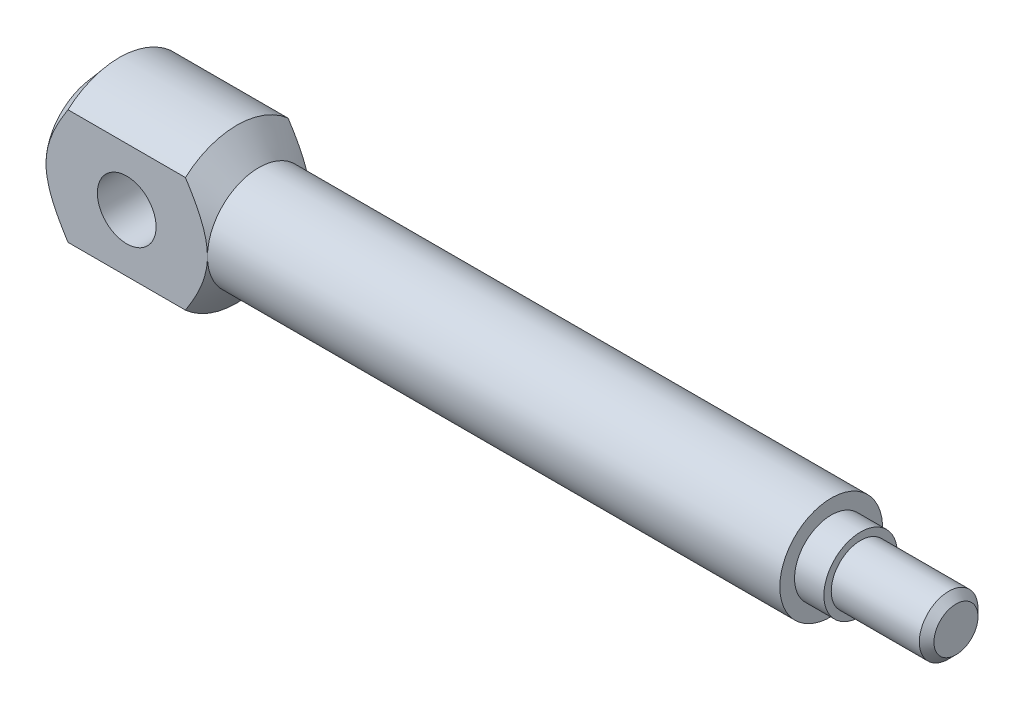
ISO-10303-21;
HEADER;
FILE_DESCRIPTION(('STEP AP214'),'2;1');
FILE_NAME('part.step','',(''),(''),'','','');
FILE_SCHEMA(('AUTOMOTIVE_DESIGN { 1 0 10303 214 1 1 1 1 }'));
ENDSEC;
DATA;
#1=APPLICATION_CONTEXT('core data for automotive mechanical design processes');
#2=APPLICATION_PROTOCOL_DEFINITION('international standard','automotive_design',2000,#1);
#3=PRODUCT_CONTEXT('',#1,'mechanical');
#4=PRODUCT('Part','Part','',(#3));
#5=PRODUCT_RELATED_PRODUCT_CATEGORY('part','',(#4));
#6=PRODUCT_DEFINITION_FORMATION('','',#4);
#7=PRODUCT_DEFINITION_CONTEXT('part definition',#1,'design');
#8=PRODUCT_DEFINITION('design','',#6,#7);
#9=PRODUCT_DEFINITION_SHAPE('','',#8);
#10=(LENGTH_UNIT() NAMED_UNIT(*) SI_UNIT(.MILLI.,.METRE.));
#11=(NAMED_UNIT(*) PLANE_ANGLE_UNIT() SI_UNIT($,.RADIAN.));
#12=(NAMED_UNIT(*) SI_UNIT($,.STERADIAN.) SOLID_ANGLE_UNIT());
#13=UNCERTAINTY_MEASURE_WITH_UNIT(LENGTH_MEASURE(1.E-05),#10,'distance_accuracy_value','');
#14=(GEOMETRIC_REPRESENTATION_CONTEXT(3) GLOBAL_UNCERTAINTY_ASSIGNED_CONTEXT((#13)) GLOBAL_UNIT_ASSIGNED_CONTEXT((#10,
#11,#12)) REPRESENTATION_CONTEXT('',''));
#15=CARTESIAN_POINT('',(0.,0.,0.));
#16=DIRECTION('',(0.,0.,1.));
#17=DIRECTION('',(1.,0.,0.));
#18=AXIS2_PLACEMENT_3D('',#15,#16,#17);
#19=CARTESIAN_POINT('',(22.,0.,0.));
#20=DIRECTION('',(-1.,0.,0.));
#21=DIRECTION('',(0.,0.,1.));
#22=AXIS2_PLACEMENT_3D('',#19,#20,#21);
#23=CONICAL_SURFACE('',#22,6.99999999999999,0.862170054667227);
#24=CARTESIAN_POINT('',(13.8028857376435,-15.0114258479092,-7.));
#25=CARTESIAN_POINT('',(14.0641424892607,-14.6750754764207,-7.));
#26=CARTESIAN_POINT('',(14.3244616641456,-14.3379913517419,-7.));
#27=CARTESIAN_POINT('',(14.842741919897,-13.6619834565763,-7.));
#28=CARTESIAN_POINT('',(15.1007028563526,-13.3230595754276,-7.));
#29=CARTESIAN_POINT('',(15.6144057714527,-12.6421740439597,-7.));
#30=CARTESIAN_POINT('',(15.8701404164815,-12.3002068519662,-7.));
#31=CARTESIAN_POINT('',(16.3780119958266,-11.6136216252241,-7.));
#32=CARTESIAN_POINT('',(16.6301490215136,-11.2690036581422,-7.));
#33=CARTESIAN_POINT('',(17.1533738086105,-10.5439847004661,-7.));
#34=CARTESIAN_POINT('',(17.4240177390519,-10.1632624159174,-7.));
#35=CARTESIAN_POINT('',(17.9582294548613,-9.39682648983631,-7.));
#36=CARTESIAN_POINT('',(18.2217966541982,-9.01111243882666,-7.));
#37=CARTESIAN_POINT('',(18.739135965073,-8.23370823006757,-7.));
#38=CARTESIAN_POINT('',(18.9929181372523,-7.84202482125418,-7.));
#39=CARTESIAN_POINT('',(19.3636672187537,-7.24833774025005,-7.));
#40=CARTESIAN_POINT('',(19.4855889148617,-7.04942766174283,-7.));
#41=CARTESIAN_POINT('',(19.7254862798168,-6.64924604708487,-7.));
#42=CARTESIAN_POINT('',(19.8434621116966,-6.44797460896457,-7.));
#43=CARTESIAN_POINT('',(20.0724388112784,-6.04670674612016,-7.));
#44=CARTESIAN_POINT('',(20.1835310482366,-5.8467625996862,-7.));
#45=CARTESIAN_POINT('',(20.4002753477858,-5.44395659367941,-7.));
#46=CARTESIAN_POINT('',(20.5059278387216,-5.24109496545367,-7.));
#47=CARTESIAN_POINT('',(20.7107664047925,-4.83191673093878,-7.));
#48=CARTESIAN_POINT('',(20.8099472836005,-4.62559751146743,-7.));
#49=CARTESIAN_POINT('',(21.0003740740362,-4.20931118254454,-7.));
#50=CARTESIAN_POINT('',(21.0916201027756,-3.99934412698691,-7.));
#51=CARTESIAN_POINT('',(21.2623900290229,-3.58067292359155,-7.));
#52=CARTESIAN_POINT('',(21.3421467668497,-3.37206438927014,-7.));
#53=CARTESIAN_POINT('',(21.4907216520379,-2.95094111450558,-7.));
#54=CARTESIAN_POINT('',(21.5595391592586,-2.7384261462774,-7.));
#55=CARTESIAN_POINT('',(21.6841158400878,-2.30993046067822,-7.));
#56=CARTESIAN_POINT('',(21.7398958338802,-2.09395586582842,-7.));
#57=CARTESIAN_POINT('',(21.8364805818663,-1.65872734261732,-7.));
#58=CARTESIAN_POINT('',(21.8772901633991,-1.43947449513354,-7.));
#59=CARTESIAN_POINT('',(21.9488644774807,-0.952609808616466,-7.));
#60=CARTESIAN_POINT('',(21.9757817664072,-0.684413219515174,-7.));
#61=CARTESIAN_POINT('',(22.0030921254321,-0.146686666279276,-7.));
#62=CARTESIAN_POINT('',(22.0034883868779,0.122843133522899,-7.));
#63=CARTESIAN_POINT('',(21.9776994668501,0.661384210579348,-7.));
#64=CARTESIAN_POINT('',(21.9514378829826,0.930391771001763,-7.));
#65=CARTESIAN_POINT('',(21.874205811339,1.46481538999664,-7.));
#66=CARTESIAN_POINT('',(21.8232279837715,1.73023035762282,-7.));
#67=CARTESIAN_POINT('',(21.6734352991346,2.36841443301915,-7.));
#68=CARTESIAN_POINT('',(21.5634865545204,2.73856910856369,-7.));
#69=CARTESIAN_POINT('',(21.3737299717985,3.28492693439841,-7.));
#70=CARTESIAN_POINT('',(21.3062985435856,3.46565617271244,-7.));
#71=CARTESIAN_POINT('',(21.1643191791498,3.8243008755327,-7.));
#72=CARTESIAN_POINT('',(21.0897718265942,4.00221656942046,-7.));
#73=CARTESIAN_POINT('',(20.9334237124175,4.3580769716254,-7.));
#74=CARTESIAN_POINT('',(20.8515290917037,4.53598011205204,-7.));
#75=CARTESIAN_POINT('',(20.6824292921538,4.88923966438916,-7.));
#76=CARTESIAN_POINT('',(20.5952240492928,5.06459604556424,-7.));
#77=CARTESIAN_POINT('',(20.4163360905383,5.41291047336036,-7.));
#78=CARTESIAN_POINT('',(20.3246552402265,5.58586948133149,-7.));
#79=CARTESIAN_POINT('',(20.137450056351,5.92967848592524,-7.));
#80=CARTESIAN_POINT('',(20.0419259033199,6.10052858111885,-7.));
#81=CARTESIAN_POINT('',(19.8261988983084,6.47773827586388,-7.));
#82=CARTESIAN_POINT('',(19.7051916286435,6.68363733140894,-7.));
#83=CARTESIAN_POINT('',(19.4590899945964,7.09298260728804,-7.));
#84=CARTESIAN_POINT('',(19.333995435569,7.29642871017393,-7.));
#85=CARTESIAN_POINT('',(18.9535540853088,7.90363714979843,-7.));
#86=CARTESIAN_POINT('',(18.6930925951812,8.30419560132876,-7.));
#87=CARTESIAN_POINT('',(18.1622071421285,9.09907504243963,-7.));
#88=CARTESIAN_POINT('',(17.8917752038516,9.49339066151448,-7.));
#89=CARTESIAN_POINT('',(17.3436931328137,10.2769034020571,-7.));
#90=CARTESIAN_POINT('',(17.0660437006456,10.6661010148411,-7.));
#91=CARTESIAN_POINT('',(16.5043485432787,11.4417645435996,-7.));
#92=CARTESIAN_POINT('',(16.2202850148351,11.8282175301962,-7.));
#93=CARTESIAN_POINT('',(15.6478727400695,12.5979437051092,-7.));
#94=CARTESIAN_POINT('',(15.3595239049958,12.9812168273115,-7.));
#95=CARTESIAN_POINT('',(14.7795857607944,13.7450170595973,-7.));
#96=CARTESIAN_POINT('',(14.4879980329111,14.1255453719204,-7.));
#97=CARTESIAN_POINT('',(13.9021106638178,14.8845097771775,-7.));
#98=CARTESIAN_POINT('',(13.6078110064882,15.2629458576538,-7.));
#99=CARTESIAN_POINT('',(12.7985992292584,16.2972807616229,-7.));
#100=CARTESIAN_POINT('',(12.2814637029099,16.9514396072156,-7.));
#101=CARTESIAN_POINT('',(11.2423596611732,18.2560408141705,-7.));
#102=CARTESIAN_POINT('',(10.7203905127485,18.9064826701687,-7.));
#103=CARTESIAN_POINT('',(9.67610130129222,20.2005215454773,-7.));
#104=CARTESIAN_POINT('',(9.15380294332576,20.8441360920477,-7.));
#105=CARTESIAN_POINT('',(8.36837836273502,21.8078617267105,-7.));
#106=CARTESIAN_POINT('',(8.10626103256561,22.128796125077,-7.));
#107=CARTESIAN_POINT('',(7.5814289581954,22.7701752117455,-7.));
#108=CARTESIAN_POINT('',(7.3187142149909,23.0906199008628,-7.));
#109=CARTESIAN_POINT('',(7.05573777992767,23.4108497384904,-7.));
#110=B_SPLINE_CURVE_WITH_KNOTS('',3,(#24,#25,#26,#27,#28,#29,#30,#31,#32,#33,#34,#35,#36,#37,
#38,#39,#40,#41,#42,#43,#44,#45,#46,#47,#48,#49,#50,#51,#52,#53,#54,#55,#56,#57,#58,#59,#60,#61,
#62,#63,#64,#65,#66,#67,#68,#69,#70,#71,#72,#73,#74,#75,#76,#77,#78,#79,#80,#81,#82,#83,#84,#85,
#86,#87,#88,#89,#90,#91,#92,#93,#94,#95,#96,#97,#98,#99,#100,#101,#102,#103,#104,#105,#106,#107,
#108,#109),.UNSPECIFIED.,.F.,.F.,(4,2,2,2,2,2,2,2,2,2,2,2,2,2,2,2,2,2,2,2,2,2,2,2,2,2,2,2,2,2,2,
2,2,2,2,2,2,2,2,2,2,2,4),(0.,1.27769017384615,2.55545807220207,3.83648351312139,
5.11747636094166,6.5187616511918,7.9201626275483,9.32008206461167,10.0199544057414,
10.7197977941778,11.4059297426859,12.0920075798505,12.7786296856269,13.465241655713,
14.1349919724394,14.8047814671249,15.4734939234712,16.1419905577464,16.9493495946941,
17.7566114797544,18.5661935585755,19.3760162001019,20.5320521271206,21.1106545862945,
21.6892096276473,22.2766553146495,22.864108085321,23.4513180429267,24.038500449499,
24.7549146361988,25.4713629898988,26.9045163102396,28.3388419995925,29.7730289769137,
31.2118608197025,32.6507225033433,34.0889101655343,35.5271063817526,38.028706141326,
40.5306382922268,43.017255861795,44.2603721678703,45.5034864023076),.UNSPECIFIED.);
#111=CARTESIAN_POINT('',(19.,7.82623792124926,-7.));
#112=VERTEX_POINT('',#111);
#113=CARTESIAN_POINT('',(22.,0.,-7.));
#114=VERTEX_POINT('',#113);
#115=EDGE_CURVE('E169',#112,#114,#110,.F.);
#116=ORIENTED_EDGE('',*,*,#115,.F.);
#117=CARTESIAN_POINT('',(19.,0.,0.));
#118=DIRECTION('',(-1.,0.,0.));
#119=DIRECTION('',(0.,0.,1.));
#120=AXIS2_PLACEMENT_3D('',#117,#118,#119);
#121=CIRCLE('',#120,10.5);
#122=CARTESIAN_POINT('',(19.,7.82623792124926,7.));
#123=VERTEX_POINT('',#122);
#124=EDGE_CURVE('E95',#123,#112,#121,.T.);
#125=ORIENTED_EDGE('',*,*,#124,.F.);
#126=CARTESIAN_POINT('',(13.8028857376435,-15.0114258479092,7.));
#127=CARTESIAN_POINT('',(14.0641424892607,-14.6750754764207,7.));
#128=CARTESIAN_POINT('',(14.3244616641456,-14.3379913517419,7.));
#129=CARTESIAN_POINT('',(14.842741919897,-13.6619834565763,7.));
#130=CARTESIAN_POINT('',(15.1007028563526,-13.3230595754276,7.));
#131=CARTESIAN_POINT('',(15.6144057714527,-12.6421740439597,7.));
#132=CARTESIAN_POINT('',(15.8701404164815,-12.3002068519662,7.));
#133=CARTESIAN_POINT('',(16.3780119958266,-11.6136216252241,7.));
#134=CARTESIAN_POINT('',(16.6301490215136,-11.2690036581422,7.));
#135=CARTESIAN_POINT('',(17.1533738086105,-10.5439847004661,7.));
#136=CARTESIAN_POINT('',(17.4240177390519,-10.1632624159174,7.));
#137=CARTESIAN_POINT('',(17.9582294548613,-9.39682648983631,7.));
#138=CARTESIAN_POINT('',(18.2217966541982,-9.01111243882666,7.));
#139=CARTESIAN_POINT('',(18.739135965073,-8.23370823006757,7.));
#140=CARTESIAN_POINT('',(18.9929181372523,-7.84202482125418,7.));
#141=CARTESIAN_POINT('',(19.3636672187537,-7.24833774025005,7.));
#142=CARTESIAN_POINT('',(19.4855889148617,-7.04942766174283,7.));
#143=CARTESIAN_POINT('',(19.7254862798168,-6.64924604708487,7.));
#144=CARTESIAN_POINT('',(19.8434621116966,-6.44797460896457,7.));
#145=CARTESIAN_POINT('',(20.0724388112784,-6.04670674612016,7.));
#146=CARTESIAN_POINT('',(20.1835310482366,-5.8467625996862,7.));
#147=CARTESIAN_POINT('',(20.4002753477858,-5.44395659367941,7.));
#148=CARTESIAN_POINT('',(20.5059278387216,-5.24109496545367,7.));
#149=CARTESIAN_POINT('',(20.7107664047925,-4.83191673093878,7.));
#150=CARTESIAN_POINT('',(20.8099472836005,-4.62559751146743,7.));
#151=CARTESIAN_POINT('',(21.0003740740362,-4.20931118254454,7.));
#152=CARTESIAN_POINT('',(21.0916201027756,-3.99934412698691,7.));
#153=CARTESIAN_POINT('',(21.2623900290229,-3.58067292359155,7.));
#154=CARTESIAN_POINT('',(21.3421467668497,-3.37206438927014,7.));
#155=CARTESIAN_POINT('',(21.4907216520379,-2.95094111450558,7.));
#156=CARTESIAN_POINT('',(21.5595391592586,-2.7384261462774,7.));
#157=CARTESIAN_POINT('',(21.6841158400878,-2.30993046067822,7.));
#158=CARTESIAN_POINT('',(21.7398958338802,-2.09395586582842,7.));
#159=CARTESIAN_POINT('',(21.8364805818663,-1.65872734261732,7.));
#160=CARTESIAN_POINT('',(21.8772901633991,-1.43947449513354,7.));
#161=CARTESIAN_POINT('',(21.9488644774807,-0.952609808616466,7.));
#162=CARTESIAN_POINT('',(21.9757817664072,-0.684413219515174,7.));
#163=CARTESIAN_POINT('',(22.0030921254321,-0.146686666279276,7.));
#164=CARTESIAN_POINT('',(22.0034883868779,0.122843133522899,7.));
#165=CARTESIAN_POINT('',(21.9776994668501,0.661384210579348,7.));
#166=CARTESIAN_POINT('',(21.9514378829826,0.930391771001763,7.));
#167=CARTESIAN_POINT('',(21.874205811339,1.46481538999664,7.));
#168=CARTESIAN_POINT('',(21.8232279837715,1.73023035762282,7.));
#169=CARTESIAN_POINT('',(21.6734352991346,2.36841443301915,7.));
#170=CARTESIAN_POINT('',(21.5634865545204,2.73856910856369,7.));
#171=CARTESIAN_POINT('',(21.3737299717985,3.28492693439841,7.));
#172=CARTESIAN_POINT('',(21.3062985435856,3.46565617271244,7.));
#173=CARTESIAN_POINT('',(21.1643191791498,3.8243008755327,7.));
#174=CARTESIAN_POINT('',(21.0897718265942,4.00221656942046,7.));
#175=CARTESIAN_POINT('',(20.9334237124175,4.3580769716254,7.));
#176=CARTESIAN_POINT('',(20.8515290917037,4.53598011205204,7.));
#177=CARTESIAN_POINT('',(20.6824292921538,4.88923966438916,7.));
#178=CARTESIAN_POINT('',(20.5952240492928,5.06459604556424,7.));
#179=CARTESIAN_POINT('',(20.4163360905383,5.41291047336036,7.));
#180=CARTESIAN_POINT('',(20.3246552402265,5.58586948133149,7.));
#181=CARTESIAN_POINT('',(20.137450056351,5.92967848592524,7.));
#182=CARTESIAN_POINT('',(20.0419259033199,6.10052858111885,7.));
#183=CARTESIAN_POINT('',(19.8261988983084,6.47773827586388,7.));
#184=CARTESIAN_POINT('',(19.7051916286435,6.68363733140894,7.));
#185=CARTESIAN_POINT('',(19.4590899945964,7.09298260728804,7.));
#186=CARTESIAN_POINT('',(19.333995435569,7.29642871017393,7.));
#187=CARTESIAN_POINT('',(18.9535540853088,7.90363714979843,7.));
#188=CARTESIAN_POINT('',(18.6930925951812,8.30419560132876,7.));
#189=CARTESIAN_POINT('',(18.1622071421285,9.09907504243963,7.));
#190=CARTESIAN_POINT('',(17.8917752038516,9.49339066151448,7.));
#191=CARTESIAN_POINT('',(17.3436931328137,10.2769034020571,7.));
#192=CARTESIAN_POINT('',(17.0660437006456,10.6661010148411,7.));
#193=CARTESIAN_POINT('',(16.5043485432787,11.4417645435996,7.));
#194=CARTESIAN_POINT('',(16.2202850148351,11.8282175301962,7.));
#195=CARTESIAN_POINT('',(15.6478727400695,12.5979437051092,7.));
#196=CARTESIAN_POINT('',(15.3595239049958,12.9812168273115,7.));
#197=CARTESIAN_POINT('',(14.7795857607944,13.7450170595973,7.));
#198=CARTESIAN_POINT('',(14.4879980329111,14.1255453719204,7.));
#199=CARTESIAN_POINT('',(13.9021106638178,14.8845097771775,7.));
#200=CARTESIAN_POINT('',(13.6078110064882,15.2629458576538,7.));
#201=CARTESIAN_POINT('',(12.7985992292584,16.2972807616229,7.));
#202=CARTESIAN_POINT('',(12.2814637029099,16.9514396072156,7.));
#203=CARTESIAN_POINT('',(11.2423596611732,18.2560408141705,7.));
#204=CARTESIAN_POINT('',(10.7203905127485,18.9064826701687,7.));
#205=CARTESIAN_POINT('',(9.67610130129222,20.2005215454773,7.));
#206=CARTESIAN_POINT('',(9.15380294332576,20.8441360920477,7.));
#207=CARTESIAN_POINT('',(8.36837836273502,21.8078617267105,7.));
#208=CARTESIAN_POINT('',(8.10626103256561,22.128796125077,7.));
#209=CARTESIAN_POINT('',(7.5814289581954,22.7701752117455,7.));
#210=CARTESIAN_POINT('',(7.3187142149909,23.0906199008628,7.));
#211=CARTESIAN_POINT('',(7.05573777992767,23.4108497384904,7.));
#212=B_SPLINE_CURVE_WITH_KNOTS('',3,(#126,#127,#128,#129,#130,#131,#132,#133,#134,#135,#136,
#137,#138,#139,#140,#141,#142,#143,#144,#145,#146,#147,#148,#149,#150,#151,#152,#153,#154,#155,
#156,#157,#158,#159,#160,#161,#162,#163,#164,#165,#166,#167,#168,#169,#170,#171,#172,#173,#174,
#175,#176,#177,#178,#179,#180,#181,#182,#183,#184,#185,#186,#187,#188,#189,#190,#191,#192,#193,
#194,#195,#196,#197,#198,#199,#200,#201,#202,#203,#204,#205,#206,#207,#208,#209,#210,#211),
.UNSPECIFIED.,.F.,.F.,(4,2,2,2,2,2,2,2,2,2,2,2,2,2,2,2,2,2,2,2,2,2,2,2,2,2,2,2,2,2,2,2,2,2,2,2,
2,2,2,2,2,2,4),(0.,1.27769017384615,2.55545807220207,3.83648351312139,5.11747636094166,
6.5187616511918,7.9201626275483,9.32008206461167,10.0199544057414,10.7197977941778,
11.4059297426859,12.0920075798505,12.7786296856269,13.465241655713,14.1349919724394,
14.8047814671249,15.4734939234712,16.1419905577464,16.9493495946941,17.7566114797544,
18.5661935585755,19.3760162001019,20.5320521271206,21.1106545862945,21.6892096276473,
22.2766553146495,22.864108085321,23.4513180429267,24.038500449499,24.7549146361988,
25.4713629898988,26.9045163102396,28.3388419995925,29.7730289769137,31.2118608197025,
32.6507225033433,34.0889101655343,35.5271063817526,38.028706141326,40.5306382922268,
43.017255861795,44.2603721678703,45.5034864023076),.UNSPECIFIED.);
#213=CARTESIAN_POINT('',(22.,0.,7.));
#214=VERTEX_POINT('',#213);
#215=EDGE_CURVE('E152',#123,#214,#212,.F.);
#216=ORIENTED_EDGE('',*,*,#215,.T.);
#217=CARTESIAN_POINT('',(22.,0.,0.));
#218=DIRECTION('',(-1.,0.,0.));
#219=DIRECTION('',(0.,0.,1.));
#220=AXIS2_PLACEMENT_3D('',#217,#218,#219);
#221=CIRCLE('',#220,6.99999999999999);
#222=EDGE_CURVE('E110',#214,#114,#221,.T.);
#223=ORIENTED_EDGE('',*,*,#222,.T.);
#224=EDGE_LOOP('',(#116,#125,#216,#223));
#225=FACE_BOUND('',#224,.T.);
#226=ADVANCED_FACE('F27',(#225),#23,.T.);
#227=CARTESIAN_POINT('',(19.,-7.82623792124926,-7.));
#228=VERTEX_POINT('',#227);
#229=EDGE_CURVE('E164',#114,#228,#110,.F.);
#230=ORIENTED_EDGE('',*,*,#229,.F.);
#231=EDGE_CURVE('E109',#114,#214,#221,.T.);
#232=ORIENTED_EDGE('',*,*,#231,.T.);
#233=CARTESIAN_POINT('',(19.,-7.82623792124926,7.));
#234=VERTEX_POINT('',#233);
#235=EDGE_CURVE('E145',#214,#234,#212,.F.);
#236=ORIENTED_EDGE('',*,*,#235,.T.);
#237=EDGE_CURVE('E101',#228,#234,#121,.T.);
#238=ORIENTED_EDGE('',*,*,#237,.F.);
#239=EDGE_LOOP('',(#230,#232,#236,#238));
#240=FACE_BOUND('',#239,.T.);
#241=ADVANCED_FACE('F158',(#240),#23,.T.);
#242=CARTESIAN_POINT('',(-40.,0.,0.));
#243=DIRECTION('',(-1.,0.,0.));
#244=DIRECTION('',(0.,0.,1.));
#245=AXIS2_PLACEMENT_3D('',#242,#243,#244);
#246=CYLINDRICAL_SURFACE('',#245,10.5);
#247=DIRECTION('',(-1.,0.,0.));
#248=VECTOR('',#247,1.);
#249=CARTESIAN_POINT('',(-40.,-7.82623792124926,-7.));
#250=LINE('',#249,#248);
#251=CARTESIAN_POINT('',(2.99999999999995,-7.8262379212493,-7.));
#252=VERTEX_POINT('',#251);
#253=EDGE_CURVE('E96',#228,#252,#250,.T.);
#254=ORIENTED_EDGE('',*,*,#253,.F.);
#255=ORIENTED_EDGE('',*,*,#237,.T.);
#256=DIRECTION('',(-1.,0.,0.));
#257=VECTOR('',#256,1.);
#258=CARTESIAN_POINT('',(-40.,-7.82623792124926,7.));
#259=LINE('',#258,#257);
#260=CARTESIAN_POINT('',(2.99999999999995,-7.8262379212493,7.));
#261=VERTEX_POINT('',#260);
#262=EDGE_CURVE('E153',#234,#261,#259,.T.);
#263=ORIENTED_EDGE('',*,*,#262,.T.);
#264=CARTESIAN_POINT('',(3.,0.,0.));
#265=DIRECTION('',(-1.,0.,0.));
#266=DIRECTION('',(0.,0.,1.));
#267=AXIS2_PLACEMENT_3D('',#264,#265,#266);
#268=CIRCLE('',#267,10.5);
#269=EDGE_CURVE('E102',#252,#261,#268,.T.);
#270=ORIENTED_EDGE('',*,*,#269,.F.);
#271=EDGE_LOOP('',(#254,#255,#263,#270));
#272=FACE_BOUND('',#271,.T.);
#273=ADVANCED_FACE('F160',(#272),#246,.T.);
#274=DIRECTION('',(-1.,0.,0.));
#275=VECTOR('',#274,1.);
#276=CARTESIAN_POINT('',(-40.,7.82623792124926,-7.));
#277=LINE('',#276,#275);
#278=CARTESIAN_POINT('',(3.,7.82623792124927,-7.));
#279=VERTEX_POINT('',#278);
#280=EDGE_CURVE('E81',#279,#112,#277,.F.);
#281=ORIENTED_EDGE('',*,*,#280,.F.);
#282=CARTESIAN_POINT('',(3.,7.82623792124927,7.));
#283=VERTEX_POINT('',#282);
#284=EDGE_CURVE('E93',#283,#279,#268,.T.);
#285=ORIENTED_EDGE('',*,*,#284,.F.);
#286=DIRECTION('',(-1.,0.,0.));
#287=VECTOR('',#286,1.);
#288=CARTESIAN_POINT('',(-40.,7.82623792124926,7.));
#289=LINE('',#288,#287);
#290=EDGE_CURVE('E50',#283,#123,#289,.F.);
#291=ORIENTED_EDGE('',*,*,#290,.T.);
#292=ORIENTED_EDGE('',*,*,#124,.T.);
#293=EDGE_LOOP('',(#281,#285,#291,#292));
#294=FACE_BOUND('',#293,.T.);
#295=ADVANCED_FACE('F92',(#294),#246,.T.);
#296=CARTESIAN_POINT('',(3.,0.,0.));
#297=DIRECTION('',(1.,0.,0.));
#298=DIRECTION('',(0.,0.,-1.));
#299=AXIS2_PLACEMENT_3D('',#296,#297,#298);
#300=CONICAL_SURFACE('',#299,10.5,0.862170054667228);
#301=CARTESIAN_POINT('',(8.19711426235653,-15.0114258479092,-7.));
#302=CARTESIAN_POINT('',(7.93585751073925,-14.6750754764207,-7.));
#303=CARTESIAN_POINT('',(7.67553833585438,-14.3379913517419,-7.));
#304=CARTESIAN_POINT('',(7.15725808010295,-13.6619834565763,-7.));
#305=CARTESIAN_POINT('',(6.8992971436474,-13.3230595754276,-7.));
#306=CARTESIAN_POINT('',(6.38559422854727,-12.6421740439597,-7.));
#307=CARTESIAN_POINT('',(6.12985958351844,-12.3002068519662,-7.));
#308=CARTESIAN_POINT('',(5.62198800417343,-11.6136216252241,-7.));
#309=CARTESIAN_POINT('',(5.36985097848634,-11.2690036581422,-7.));
#310=CARTESIAN_POINT('',(4.84662619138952,-10.5439847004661,-7.));
#311=CARTESIAN_POINT('',(4.57598226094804,-10.1632624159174,-7.));
#312=CARTESIAN_POINT('',(4.04177054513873,-9.39682648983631,-7.));
#313=CARTESIAN_POINT('',(3.77820334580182,-9.01111243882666,-7.));
#314=CARTESIAN_POINT('',(3.26086403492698,-8.23370823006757,-7.));
#315=CARTESIAN_POINT('',(3.0070818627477,-7.84202482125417,-7.));
#316=CARTESIAN_POINT('',(2.6363327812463,-7.24833774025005,-7.));
#317=CARTESIAN_POINT('',(2.51441108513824,-7.04942766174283,-7.));
#318=CARTESIAN_POINT('',(2.27451372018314,-6.64924604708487,-7.));
#319=CARTESIAN_POINT('',(2.15653788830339,-6.44797460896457,-7.));
#320=CARTESIAN_POINT('',(1.92756118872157,-6.04670674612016,-7.));
#321=CARTESIAN_POINT('',(1.81646895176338,-5.84676259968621,-7.));
#322=CARTESIAN_POINT('',(1.5997246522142,-5.44395659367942,-7.));
#323=CARTESIAN_POINT('',(1.4940721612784,-5.24109496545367,-7.));
#324=CARTESIAN_POINT('',(1.28923359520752,-4.83191673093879,-7.));
#325=CARTESIAN_POINT('',(1.19005271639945,-4.62559751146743,-7.));
#326=CARTESIAN_POINT('',(0.999625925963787,-4.20931118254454,-7.));
#327=CARTESIAN_POINT('',(0.908379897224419,-3.99934412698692,-7.));
#328=CARTESIAN_POINT('',(0.737609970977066,-3.58067292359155,-7.));
#329=CARTESIAN_POINT('',(0.657853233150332,-3.37206438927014,-7.));
#330=CARTESIAN_POINT('',(0.509278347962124,-2.95094111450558,-7.));
#331=CARTESIAN_POINT('',(0.440460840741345,-2.7384261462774,-7.));
#332=CARTESIAN_POINT('',(0.315884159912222,-2.30993046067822,-7.));
#333=CARTESIAN_POINT('',(0.260104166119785,-2.09395586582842,-7.));
#334=CARTESIAN_POINT('',(0.163519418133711,-1.65872734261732,-7.));
#335=CARTESIAN_POINT('',(0.122709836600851,-1.43947449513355,-7.));
#336=CARTESIAN_POINT('',(0.0511355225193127,-0.952609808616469,-7.));
#337=CARTESIAN_POINT('',(0.0242182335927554,-0.684413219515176,-7.));
#338=CARTESIAN_POINT('',(-0.00309212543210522,-0.146686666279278,-7.));
#339=CARTESIAN_POINT('',(-0.00348838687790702,0.122843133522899,-7.));
#340=CARTESIAN_POINT('',(0.0223005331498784,0.661384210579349,-7.));
#341=CARTESIAN_POINT('',(0.0485621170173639,0.930391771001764,-7.));
#342=CARTESIAN_POINT('',(0.125794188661,1.46481538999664,-7.));
#343=CARTESIAN_POINT('',(0.176772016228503,1.73023035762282,-7.));
#344=CARTESIAN_POINT('',(0.32656470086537,2.36841443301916,-7.));
#345=CARTESIAN_POINT('',(0.436513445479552,2.73856910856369,-7.));
#346=CARTESIAN_POINT('',(0.626270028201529,3.28492693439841,-7.));
#347=CARTESIAN_POINT('',(0.69370145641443,3.46565617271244,-7.));
#348=CARTESIAN_POINT('',(0.835680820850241,3.82430087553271,-7.));
#349=CARTESIAN_POINT('',(0.910228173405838,4.00221656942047,-7.));
#350=CARTESIAN_POINT('',(1.0665762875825,4.35807697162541,-7.));
#351=CARTESIAN_POINT('',(1.14847090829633,4.53598011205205,-7.));
#352=CARTESIAN_POINT('',(1.31757070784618,4.88923966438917,-7.));
#353=CARTESIAN_POINT('',(1.40477595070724,5.06459604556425,-7.));
#354=CARTESIAN_POINT('',(1.58366390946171,5.41291047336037,-7.));
#355=CARTESIAN_POINT('',(1.67534475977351,5.5858694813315,-7.));
#356=CARTESIAN_POINT('',(1.86254994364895,5.92967848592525,-7.));
#357=CARTESIAN_POINT('',(1.95807409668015,6.10052858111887,-7.));
#358=CARTESIAN_POINT('',(2.17380110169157,6.4777382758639,-7.));
#359=CARTESIAN_POINT('',(2.29480837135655,6.68363733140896,-7.));
#360=CARTESIAN_POINT('',(2.54091000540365,7.09298260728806,-7.));
#361=CARTESIAN_POINT('',(2.66600456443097,7.29642871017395,-7.));
#362=CARTESIAN_POINT('',(3.04644591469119,7.90363714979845,-7.));
#363=CARTESIAN_POINT('',(3.30690740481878,8.30419560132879,-7.));
#364=CARTESIAN_POINT('',(3.83779285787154,9.09907504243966,-7.));
#365=CARTESIAN_POINT('',(4.10822479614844,9.49339066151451,-7.));
#366=CARTESIAN_POINT('',(4.65630686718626,10.2769034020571,-7.));
#367=CARTESIAN_POINT('',(4.93395629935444,10.6661010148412,-7.));
#368=CARTESIAN_POINT('',(5.4956514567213,11.4417645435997,-7.));
#369=CARTESIAN_POINT('',(5.7797149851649,11.8282175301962,-7.));
#370=CARTESIAN_POINT('',(6.35212725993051,12.5979437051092,-7.));
#371=CARTESIAN_POINT('',(6.64047609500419,12.9812168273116,-7.));
#372=CARTESIAN_POINT('',(7.2204142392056,13.7450170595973,-7.));
#373=CARTESIAN_POINT('',(7.5120019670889,14.1255453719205,-7.));
#374=CARTESIAN_POINT('',(8.09788933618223,14.8845097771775,-7.));
#375=CARTESIAN_POINT('',(8.39218899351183,15.2629458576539,-7.));
#376=CARTESIAN_POINT('',(9.2014007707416,16.2972807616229,-7.));
#377=CARTESIAN_POINT('',(9.7185362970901,16.9514396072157,-7.));
#378=CARTESIAN_POINT('',(10.7576403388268,18.2560408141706,-7.));
#379=CARTESIAN_POINT('',(11.2796094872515,18.9064826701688,-7.));
#380=CARTESIAN_POINT('',(12.3238986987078,20.2005215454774,-7.));
#381=CARTESIAN_POINT('',(12.8461970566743,20.8441360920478,-7.));
#382=CARTESIAN_POINT('',(13.631621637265,21.8078617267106,-7.));
#383=CARTESIAN_POINT('',(13.8937389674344,22.128796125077,-7.));
#384=CARTESIAN_POINT('',(14.4185710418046,22.7701752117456,-7.));
#385=CARTESIAN_POINT('',(14.6812857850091,23.0906199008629,-7.));
#386=CARTESIAN_POINT('',(14.9442622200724,23.4108497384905,-7.));
#387=B_SPLINE_CURVE_WITH_KNOTS('',3,(#301,#302,#303,#304,#305,#306,#307,#308,#309,#310,#311,
#312,#313,#314,#315,#316,#317,#318,#319,#320,#321,#322,#323,#324,#325,#326,#327,#328,#329,#330,
#331,#332,#333,#334,#335,#336,#337,#338,#339,#340,#341,#342,#343,#344,#345,#346,#347,#348,#349,
#350,#351,#352,#353,#354,#355,#356,#357,#358,#359,#360,#361,#362,#363,#364,#365,#366,#367,#368,
#369,#370,#371,#372,#373,#374,#375,#376,#377,#378,#379,#380,#381,#382,#383,#384,#385,#386),
.UNSPECIFIED.,.F.,.F.,(4,2,2,2,2,2,2,2,2,2,2,2,2,2,2,2,2,2,2,2,2,2,2,2,2,2,2,2,2,2,2,2,2,2,2,2,
2,2,2,2,2,2,4),(0.,1.27769017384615,2.55545807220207,3.83648351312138,5.11747636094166,
6.51876165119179,7.92016262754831,9.32008206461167,10.0199544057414,10.7197977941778,
11.4059297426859,12.0920075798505,12.7786296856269,13.465241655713,14.1349919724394,
14.8047814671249,15.4734939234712,16.1419905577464,16.9493495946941,17.7566114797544,
18.5661935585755,19.3760162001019,20.5320521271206,21.1106545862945,21.6892096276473,
22.2766553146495,22.864108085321,23.4513180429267,24.038500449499,24.7549146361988,
25.4713629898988,26.9045163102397,28.3388419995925,29.7730289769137,31.2118608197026,
32.6507225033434,34.0889101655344,35.5271063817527,38.028706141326,40.5306382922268,
43.0172558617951,44.2603721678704,45.5034864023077),.UNSPECIFIED.);
#388=CARTESIAN_POINT('',(0.,0.,-7.));
#389=VERTEX_POINT('',#388);
#390=EDGE_CURVE('E42',#252,#389,#387,.T.);
#391=ORIENTED_EDGE('',*,*,#390,.F.);
#392=ORIENTED_EDGE('',*,*,#269,.T.);
#393=CARTESIAN_POINT('',(8.19711426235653,-15.0114258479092,7.));
#394=CARTESIAN_POINT('',(7.93585751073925,-14.6750754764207,7.));
#395=CARTESIAN_POINT('',(7.67553833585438,-14.3379913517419,7.));
#396=CARTESIAN_POINT('',(7.15725808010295,-13.6619834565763,7.));
#397=CARTESIAN_POINT('',(6.8992971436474,-13.3230595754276,7.));
#398=CARTESIAN_POINT('',(6.38559422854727,-12.6421740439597,7.));
#399=CARTESIAN_POINT('',(6.12985958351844,-12.3002068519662,7.));
#400=CARTESIAN_POINT('',(5.62198800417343,-11.6136216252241,7.));
#401=CARTESIAN_POINT('',(5.36985097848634,-11.2690036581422,7.));
#402=CARTESIAN_POINT('',(4.84662619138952,-10.5439847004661,7.));
#403=CARTESIAN_POINT('',(4.57598226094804,-10.1632624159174,7.));
#404=CARTESIAN_POINT('',(4.04177054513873,-9.39682648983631,7.));
#405=CARTESIAN_POINT('',(3.77820334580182,-9.01111243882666,7.));
#406=CARTESIAN_POINT('',(3.26086403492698,-8.23370823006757,7.));
#407=CARTESIAN_POINT('',(3.0070818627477,-7.84202482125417,7.));
#408=CARTESIAN_POINT('',(2.6363327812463,-7.24833774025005,7.));
#409=CARTESIAN_POINT('',(2.51441108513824,-7.04942766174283,7.));
#410=CARTESIAN_POINT('',(2.27451372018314,-6.64924604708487,7.));
#411=CARTESIAN_POINT('',(2.15653788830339,-6.44797460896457,7.));
#412=CARTESIAN_POINT('',(1.92756118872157,-6.04670674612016,7.));
#413=CARTESIAN_POINT('',(1.81646895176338,-5.84676259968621,7.));
#414=CARTESIAN_POINT('',(1.5997246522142,-5.44395659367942,7.));
#415=CARTESIAN_POINT('',(1.4940721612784,-5.24109496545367,7.));
#416=CARTESIAN_POINT('',(1.28923359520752,-4.83191673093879,7.));
#417=CARTESIAN_POINT('',(1.19005271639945,-4.62559751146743,7.));
#418=CARTESIAN_POINT('',(0.999625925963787,-4.20931118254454,7.));
#419=CARTESIAN_POINT('',(0.908379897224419,-3.99934412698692,7.));
#420=CARTESIAN_POINT('',(0.737609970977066,-3.58067292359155,7.));
#421=CARTESIAN_POINT('',(0.657853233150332,-3.37206438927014,7.));
#422=CARTESIAN_POINT('',(0.509278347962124,-2.95094111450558,7.));
#423=CARTESIAN_POINT('',(0.440460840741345,-2.7384261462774,7.));
#424=CARTESIAN_POINT('',(0.315884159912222,-2.30993046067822,7.));
#425=CARTESIAN_POINT('',(0.260104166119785,-2.09395586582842,7.));
#426=CARTESIAN_POINT('',(0.163519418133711,-1.65872734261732,7.));
#427=CARTESIAN_POINT('',(0.122709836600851,-1.43947449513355,7.));
#428=CARTESIAN_POINT('',(0.0511355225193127,-0.952609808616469,7.));
#429=CARTESIAN_POINT('',(0.0242182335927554,-0.684413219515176,7.));
#430=CARTESIAN_POINT('',(-0.00309212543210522,-0.146686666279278,7.));
#431=CARTESIAN_POINT('',(-0.00348838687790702,0.122843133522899,7.));
#432=CARTESIAN_POINT('',(0.0223005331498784,0.661384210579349,7.));
#433=CARTESIAN_POINT('',(0.0485621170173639,0.930391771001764,7.));
#434=CARTESIAN_POINT('',(0.125794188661,1.46481538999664,7.));
#435=CARTESIAN_POINT('',(0.176772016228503,1.73023035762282,7.));
#436=CARTESIAN_POINT('',(0.32656470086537,2.36841443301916,7.));
#437=CARTESIAN_POINT('',(0.436513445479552,2.73856910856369,7.));
#438=CARTESIAN_POINT('',(0.626270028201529,3.28492693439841,7.));
#439=CARTESIAN_POINT('',(0.69370145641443,3.46565617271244,7.));
#440=CARTESIAN_POINT('',(0.835680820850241,3.82430087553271,7.));
#441=CARTESIAN_POINT('',(0.910228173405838,4.00221656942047,7.));
#442=CARTESIAN_POINT('',(1.0665762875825,4.35807697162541,7.));
#443=CARTESIAN_POINT('',(1.14847090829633,4.53598011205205,7.));
#444=CARTESIAN_POINT('',(1.31757070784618,4.88923966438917,7.));
#445=CARTESIAN_POINT('',(1.40477595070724,5.06459604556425,7.));
#446=CARTESIAN_POINT('',(1.58366390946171,5.41291047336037,7.));
#447=CARTESIAN_POINT('',(1.67534475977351,5.5858694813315,7.));
#448=CARTESIAN_POINT('',(1.86254994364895,5.92967848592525,7.));
#449=CARTESIAN_POINT('',(1.95807409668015,6.10052858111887,7.));
#450=CARTESIAN_POINT('',(2.17380110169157,6.4777382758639,7.));
#451=CARTESIAN_POINT('',(2.29480837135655,6.68363733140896,7.));
#452=CARTESIAN_POINT('',(2.54091000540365,7.09298260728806,7.));
#453=CARTESIAN_POINT('',(2.66600456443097,7.29642871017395,7.));
#454=CARTESIAN_POINT('',(3.04644591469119,7.90363714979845,7.));
#455=CARTESIAN_POINT('',(3.30690740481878,8.30419560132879,7.));
#456=CARTESIAN_POINT('',(3.83779285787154,9.09907504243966,7.));
#457=CARTESIAN_POINT('',(4.10822479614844,9.49339066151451,7.));
#458=CARTESIAN_POINT('',(4.65630686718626,10.2769034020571,7.));
#459=CARTESIAN_POINT('',(4.93395629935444,10.6661010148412,7.));
#460=CARTESIAN_POINT('',(5.4956514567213,11.4417645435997,7.));
#461=CARTESIAN_POINT('',(5.7797149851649,11.8282175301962,7.));
#462=CARTESIAN_POINT('',(6.35212725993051,12.5979437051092,7.));
#463=CARTESIAN_POINT('',(6.64047609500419,12.9812168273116,7.));
#464=CARTESIAN_POINT('',(7.2204142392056,13.7450170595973,7.));
#465=CARTESIAN_POINT('',(7.5120019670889,14.1255453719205,7.));
#466=CARTESIAN_POINT('',(8.09788933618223,14.8845097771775,7.));
#467=CARTESIAN_POINT('',(8.39218899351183,15.2629458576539,7.));
#468=CARTESIAN_POINT('',(9.2014007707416,16.2972807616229,7.));
#469=CARTESIAN_POINT('',(9.7185362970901,16.9514396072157,7.));
#470=CARTESIAN_POINT('',(10.7576403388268,18.2560408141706,7.));
#471=CARTESIAN_POINT('',(11.2796094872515,18.9064826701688,7.));
#472=CARTESIAN_POINT('',(12.3238986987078,20.2005215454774,7.));
#473=CARTESIAN_POINT('',(12.8461970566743,20.8441360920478,7.));
#474=CARTESIAN_POINT('',(13.631621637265,21.8078617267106,7.));
#475=CARTESIAN_POINT('',(13.8937389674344,22.128796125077,7.));
#476=CARTESIAN_POINT('',(14.4185710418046,22.7701752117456,7.));
#477=CARTESIAN_POINT('',(14.6812857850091,23.0906199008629,7.));
#478=CARTESIAN_POINT('',(14.9442622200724,23.4108497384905,7.));
#479=B_SPLINE_CURVE_WITH_KNOTS('',3,(#393,#394,#395,#396,#397,#398,#399,#400,#401,#402,#403,
#404,#405,#406,#407,#408,#409,#410,#411,#412,#413,#414,#415,#416,#417,#418,#419,#420,#421,#422,
#423,#424,#425,#426,#427,#428,#429,#430,#431,#432,#433,#434,#435,#436,#437,#438,#439,#440,#441,
#442,#443,#444,#445,#446,#447,#448,#449,#450,#451,#452,#453,#454,#455,#456,#457,#458,#459,#460,
#461,#462,#463,#464,#465,#466,#467,#468,#469,#470,#471,#472,#473,#474,#475,#476,#477,#478),
.UNSPECIFIED.,.F.,.F.,(4,2,2,2,2,2,2,2,2,2,2,2,2,2,2,2,2,2,2,2,2,2,2,2,2,2,2,2,2,2,2,2,2,2,2,2,
2,2,2,2,2,2,4),(0.,1.27769017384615,2.55545807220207,3.83648351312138,5.11747636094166,
6.51876165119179,7.92016262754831,9.32008206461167,10.0199544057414,10.7197977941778,
11.4059297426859,12.0920075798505,12.7786296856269,13.465241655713,14.1349919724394,
14.8047814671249,15.4734939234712,16.1419905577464,16.9493495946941,17.7566114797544,
18.5661935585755,19.3760162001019,20.5320521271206,21.1106545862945,21.6892096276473,
22.2766553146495,22.864108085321,23.4513180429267,24.038500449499,24.7549146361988,
25.4713629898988,26.9045163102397,28.3388419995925,29.7730289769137,31.2118608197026,
32.6507225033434,34.0889101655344,35.5271063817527,38.028706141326,40.5306382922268,
43.0172558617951,44.2603721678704,45.5034864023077),.UNSPECIFIED.);
#480=CARTESIAN_POINT('',(0.,0.,7.));
#481=VERTEX_POINT('',#480);
#482=EDGE_CURVE('E87',#261,#481,#479,.T.);
#483=ORIENTED_EDGE('',*,*,#482,.T.);
#484=CARTESIAN_POINT('',(0.,0.,0.));
#485=DIRECTION('',(-1.,0.,0.));
#486=DIRECTION('',(0.,0.,1.));
#487=AXIS2_PLACEMENT_3D('',#484,#485,#486);
#488=CIRCLE('',#487,7.);
#489=EDGE_CURVE('E181',#389,#481,#488,.T.);
#490=ORIENTED_EDGE('',*,*,#489,.F.);
#491=EDGE_LOOP('',(#391,#392,#483,#490));
#492=FACE_BOUND('',#491,.T.);
#493=ADVANCED_FACE('F134',(#492),#300,.T.);
#494=EDGE_CURVE('E78',#389,#279,#387,.T.);
#495=ORIENTED_EDGE('',*,*,#494,.F.);
#496=EDGE_CURVE('E105',#481,#389,#488,.T.);
#497=ORIENTED_EDGE('',*,*,#496,.F.);
#498=EDGE_CURVE('E100',#481,#283,#479,.T.);
#499=ORIENTED_EDGE('',*,*,#498,.T.);
#500=ORIENTED_EDGE('',*,*,#284,.T.);
#501=EDGE_LOOP('',(#495,#497,#499,#500));
#502=FACE_BOUND('',#501,.T.);
#503=ADVANCED_FACE('F99',(#502),#300,.T.);
#504=CARTESIAN_POINT('',(0.,7.,0.));
#505=DIRECTION('',(1.,0.,0.));
#506=DIRECTION('',(0.,0.,-1.));
#507=AXIS2_PLACEMENT_3D('',#504,#505,#506);
#508=PLANE('',#507);
#509=ORIENTED_EDGE('',*,*,#496,.T.);
#510=ORIENTED_EDGE('',*,*,#489,.T.);
#511=EDGE_LOOP('',(#509,#510));
#512=FACE_BOUND('',#511,.T.);
#513=ADVANCED_FACE('F29',(#512),#508,.F.);
#514=CARTESIAN_POINT('',(117.,0.,0.));
#515=DIRECTION('',(-1.,0.,0.));
#516=DIRECTION('',(0.,0.,1.));
#517=AXIS2_PLACEMENT_3D('',#514,#515,#516);
#518=PLANE('',#517);
#519=CARTESIAN_POINT('',(117.,0.,0.));
#520=DIRECTION('',(-1.,0.,0.));
#521=DIRECTION('',(0.,0.,1.));
#522=AXIS2_PLACEMENT_3D('',#519,#520,#521);
#523=CIRCLE('',#522,2.99999999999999);
#524=CARTESIAN_POINT('',(117.,0.,2.99999999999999));
#525=VERTEX_POINT('',#524);
#526=EDGE_CURVE('E11',#525,#525,#523,.F.);
#527=ORIENTED_EDGE('',*,*,#526,.T.);
#528=EDGE_LOOP('',(#527));
#529=FACE_BOUND('',#528,.T.);
#530=ADVANCED_FACE('F185',(#529),#518,.F.);
#531=CARTESIAN_POINT('',(-40.,0.,0.));
#532=DIRECTION('',(-1.,0.,0.));
#533=DIRECTION('',(0.,0.,1.));
#534=AXIS2_PLACEMENT_3D('',#531,#532,#533);
#535=CYLINDRICAL_SURFACE('',#534,4.);
#536=CARTESIAN_POINT('',(116.,0.,0.));
#537=DIRECTION('',(-1.,0.,0.));
#538=DIRECTION('',(0.,0.,1.));
#539=AXIS2_PLACEMENT_3D('',#536,#537,#538);
#540=CIRCLE('',#539,4.);
#541=CARTESIAN_POINT('',(116.,0.,4.));
#542=VERTEX_POINT('',#541);
#543=EDGE_CURVE('E35',#542,#542,#540,.T.);
#544=ORIENTED_EDGE('',*,*,#543,.T.);
#545=EDGE_LOOP('',(#544));
#546=FACE_BOUND('',#545,.T.);
#547=CARTESIAN_POINT('',(104.,0.,0.));
#548=DIRECTION('',(-1.,0.,0.));
#549=DIRECTION('',(0.,0.,1.));
#550=AXIS2_PLACEMENT_3D('',#547,#548,#549);
#551=CIRCLE('',#550,4.);
#552=CARTESIAN_POINT('',(104.,0.,4.));
#553=VERTEX_POINT('',#552);
#554=EDGE_CURVE('E122',#553,#553,#551,.T.);
#555=ORIENTED_EDGE('',*,*,#554,.F.);
#556=EDGE_LOOP('',(#555));
#557=FACE_BOUND('',#556,.T.);
#558=ADVANCED_FACE('F190',(#546,#557),#535,.T.);
#559=CARTESIAN_POINT('',(104.,4.,0.));
#560=DIRECTION('',(-1.,0.,0.));
#561=DIRECTION('',(0.,0.,1.));
#562=AXIS2_PLACEMENT_3D('',#559,#560,#561);
#563=PLANE('',#562);
#564=CARTESIAN_POINT('',(104.,0.,0.));
#565=DIRECTION('',(-1.,0.,0.));
#566=DIRECTION('',(0.,0.,1.));
#567=AXIS2_PLACEMENT_3D('',#564,#565,#566);
#568=CIRCLE('',#567,5.);
#569=CARTESIAN_POINT('',(104.,0.,5.));
#570=VERTEX_POINT('',#569);
#571=EDGE_CURVE('E119',#570,#570,#568,.T.);
#572=ORIENTED_EDGE('',*,*,#571,.F.);
#573=EDGE_LOOP('',(#572));
#574=FACE_BOUND('',#573,.T.);
#575=ORIENTED_EDGE('',*,*,#554,.T.);
#576=EDGE_LOOP('',(#575));
#577=FACE_BOUND('',#576,.T.);
#578=ADVANCED_FACE('F244',(#574,#577),#563,.F.);
#579=CARTESIAN_POINT('',(-40.,0.,0.));
#580=DIRECTION('',(-1.,0.,0.));
#581=DIRECTION('',(0.,0.,1.));
#582=AXIS2_PLACEMENT_3D('',#579,#580,#581);
#583=CYLINDRICAL_SURFACE('',#582,5.);
#584=CARTESIAN_POINT('',(100.,0.,0.));
#585=DIRECTION('',(-1.,0.,0.));
#586=DIRECTION('',(0.,0.,1.));
#587=AXIS2_PLACEMENT_3D('',#584,#585,#586);
#588=CIRCLE('',#587,5.);
#589=CARTESIAN_POINT('',(100.,0.,5.));
#590=VERTEX_POINT('',#589);
#591=EDGE_CURVE('E116',#590,#590,#588,.T.);
#592=ORIENTED_EDGE('',*,*,#591,.F.);
#593=EDGE_LOOP('',(#592));
#594=FACE_BOUND('',#593,.T.);
#595=ORIENTED_EDGE('',*,*,#571,.T.);
#596=EDGE_LOOP('',(#595));
#597=FACE_BOUND('',#596,.T.);
#598=ADVANCED_FACE('F249',(#594,#597),#583,.T.);
#599=CARTESIAN_POINT('',(100.,5.,0.));
#600=DIRECTION('',(-1.,0.,0.));
#601=DIRECTION('',(0.,0.,1.));
#602=AXIS2_PLACEMENT_3D('',#599,#600,#601);
#603=PLANE('',#602);
#604=CARTESIAN_POINT('',(100.,0.,0.));
#605=DIRECTION('',(-1.,0.,0.));
#606=DIRECTION('',(0.,0.,1.));
#607=AXIS2_PLACEMENT_3D('',#604,#605,#606);
#608=CIRCLE('',#607,6.99999999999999);
#609=CARTESIAN_POINT('',(100.,0.,6.99999999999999));
#610=VERTEX_POINT('',#609);
#611=EDGE_CURVE('E113',#610,#610,#608,.T.);
#612=ORIENTED_EDGE('',*,*,#611,.F.);
#613=EDGE_LOOP('',(#612));
#614=FACE_BOUND('',#613,.T.);
#615=ORIENTED_EDGE('',*,*,#591,.T.);
#616=EDGE_LOOP('',(#615));
#617=FACE_BOUND('',#616,.T.);
#618=ADVANCED_FACE('F255',(#614,#617),#603,.F.);
#619=CARTESIAN_POINT('',(-40.,0.,0.));
#620=DIRECTION('',(-1.,0.,0.));
#621=DIRECTION('',(0.,0.,1.));
#622=AXIS2_PLACEMENT_3D('',#619,#620,#621);
#623=CYLINDRICAL_SURFACE('',#622,6.99999999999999);
#624=ORIENTED_EDGE('',*,*,#231,.F.);
#625=ORIENTED_EDGE('',*,*,#222,.F.);
#626=EDGE_LOOP('',(#624,#625));
#627=FACE_BOUND('',#626,.T.);
#628=ORIENTED_EDGE('',*,*,#611,.T.);
#629=EDGE_LOOP('',(#628));
#630=FACE_BOUND('',#629,.T.);
#631=ADVANCED_FACE('F140',(#627,#630),#623,.T.);
#632=CARTESIAN_POINT('',(-10.,-20.,7.));
#633=DIRECTION('',(0.,0.,-1.));
#634=DIRECTION('',(-1.,0.,0.));
#635=AXIS2_PLACEMENT_3D('',#632,#633,#634);
#636=PLANE('',#635);
#637=CARTESIAN_POINT('',(11.,0.,7.));
#638=DIRECTION('',(0.,0.,1.));
#639=DIRECTION('',(1.,0.,0.));
#640=AXIS2_PLACEMENT_3D('',#637,#638,#639);
#641=CIRCLE('',#640,4.);
#642=CARTESIAN_POINT('',(15.,0.,7.));
#643=VERTEX_POINT('',#642);
#644=EDGE_CURVE('E309',#643,#643,#641,.T.);
#645=ORIENTED_EDGE('',*,*,#644,.F.);
#646=EDGE_LOOP('',(#645));
#647=FACE_BOUND('',#646,.T.);
#648=ORIENTED_EDGE('',*,*,#290,.F.);
#649=ORIENTED_EDGE('',*,*,#498,.F.);
#650=ORIENTED_EDGE('',*,*,#482,.F.);
#651=ORIENTED_EDGE('',*,*,#262,.F.);
#652=ORIENTED_EDGE('',*,*,#235,.F.);
#653=ORIENTED_EDGE('',*,*,#215,.F.);
#654=EDGE_LOOP('',(#648,#649,#650,#651,#652,#653));
#655=FACE_BOUND('',#654,.T.);
#656=ADVANCED_FACE('F137',(#647,#655),#636,.F.);
#657=CARTESIAN_POINT('',(-10.,-20.,-7.));
#658=DIRECTION('',(0.,0.,-1.));
#659=DIRECTION('',(-1.,0.,0.));
#660=AXIS2_PLACEMENT_3D('',#657,#658,#659);
#661=PLANE('',#660);
#662=CARTESIAN_POINT('',(11.,0.,-7.));
#663=DIRECTION('',(0.,0.,1.));
#664=DIRECTION('',(1.,0.,0.));
#665=AXIS2_PLACEMENT_3D('',#662,#663,#664);
#666=CIRCLE('',#665,4.);
#667=CARTESIAN_POINT('',(15.,0.,-7.));
#668=VERTEX_POINT('',#667);
#669=EDGE_CURVE('E97',#668,#668,#666,.T.);
#670=ORIENTED_EDGE('',*,*,#669,.T.);
#671=EDGE_LOOP('',(#670));
#672=FACE_BOUND('',#671,.T.);
#673=ORIENTED_EDGE('',*,*,#115,.T.);
#674=ORIENTED_EDGE('',*,*,#229,.T.);
#675=ORIENTED_EDGE('',*,*,#253,.T.);
#676=ORIENTED_EDGE('',*,*,#390,.T.);
#677=ORIENTED_EDGE('',*,*,#494,.T.);
#678=ORIENTED_EDGE('',*,*,#280,.T.);
#679=EDGE_LOOP('',(#673,#674,#675,#676,#677,#678));
#680=FACE_BOUND('',#679,.T.);
#681=ADVANCED_FACE('F80',(#672,#680),#661,.T.);
#682=CARTESIAN_POINT('',(11.,0.,-7.));
#683=DIRECTION('',(0.,0.,1.));
#684=DIRECTION('',(1.,0.,0.));
#685=AXIS2_PLACEMENT_3D('',#682,#683,#684);
#686=CYLINDRICAL_SURFACE('',#685,4.);
#687=ORIENTED_EDGE('',*,*,#669,.F.);
#688=EDGE_LOOP('',(#687));
#689=FACE_BOUND('',#688,.T.);
#690=ORIENTED_EDGE('',*,*,#644,.T.);
#691=EDGE_LOOP('',(#690));
#692=FACE_BOUND('',#691,.T.);
#693=ADVANCED_FACE('F221',(#689,#692),#686,.F.);
#694=CARTESIAN_POINT('',(116.,0.,0.));
#695=DIRECTION('',(-1.,0.,0.));
#696=DIRECTION('',(0.,0.,1.));
#697=AXIS2_PLACEMENT_3D('',#694,#695,#696);
#698=CONICAL_SURFACE('',#697,4.,0.785398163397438);
#699=ORIENTED_EDGE('',*,*,#526,.F.);
#700=EDGE_LOOP('',(#699));
#701=FACE_BOUND('',#700,.T.);
#702=ORIENTED_EDGE('',*,*,#543,.F.);
#703=EDGE_LOOP('',(#702));
#704=FACE_BOUND('',#703,.T.);
#705=ADVANCED_FACE('F228',(#701,#704),#698,.T.);
#706=CLOSED_SHELL('',(#226,#241,#273,#295,#493,#503,#513,#530,#558,#578,#598,#618,#631,#656,
#681,#693,#705));
#707=MANIFOLD_SOLID_BREP('B2',#706);
#708=ADVANCED_BREP_SHAPE_REPRESENTATION('',(#18,#707),#14);
#709=SHAPE_DEFINITION_REPRESENTATION(#9,#708);
ENDSEC;
END-ISO-10303-21;
